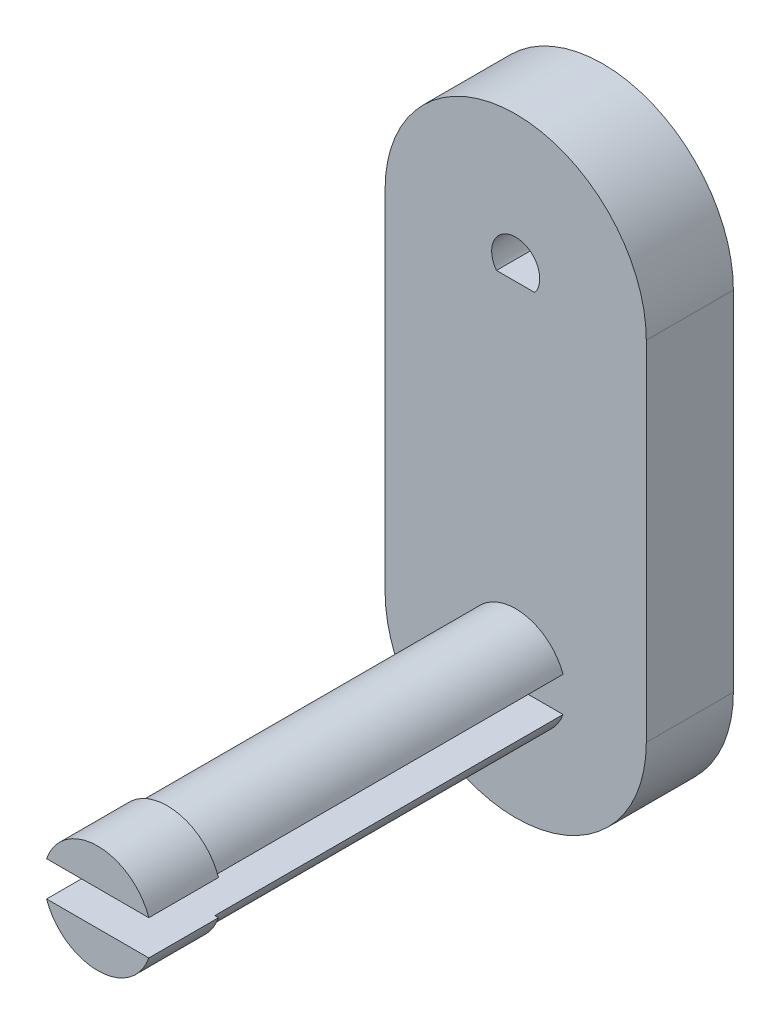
from build123d import *

# Parameters (mm, degrees)
BOSS_EXTRU_1_START      = 10
BOSS_EXTRU_1_DEPTH      = 5
ESQUISSE2_R             = 2.9
BOSS_EXTRU_2_DEPTH      = 20
ESQUISSE3_R             = 3.1
BOSS_EXTRU_3_DEPTH      = 4
ESQUISSE4_W             = 10
ESQUISSE4_H             = 2
ENL_V_MAT_EXTRU_1_DEPTH = 24
ENL_V_MAT_EXTRU_2_DEPTH = 24


with BuildPart() as part:
    # Esquisse1 → Boss.-Extru.1 (new body)
    with BuildSketch(Plane(origin=(0, 0, 0), x_dir=(-1, 0, 0), z_dir=(0, 0, -1)).offset(BOSS_EXTRU_1_START)):
        with BuildLine():
            Line((7.5, 0), (7.5, -20))
            ThreePointArc((7.5, -20), (0, -27.5), (-7.5, -20))
            Line((-7.5, -20), (-7.5, 0))
            ThreePointArc((-7.5, 0), (0, 7.5), (7.5, 0))
        make_face()
    extrude(amount=BOSS_EXTRU_1_DEPTH)

    # Esquisse2 → Boss.-Extru.2 (add)
    with BuildSketch(Plane.XY.offset(-10)):
        with Locations(Location((0, -20, 0), (0, 0, 180))):
            Circle(ESQUISSE2_R)
    extrude(amount=BOSS_EXTRU_2_DEPTH)

    # Esquisse3 → Boss.-Extru.3 (add)
    with BuildSketch(Plane.XY.offset(10)):
        with Locations((0, -20)):
            Circle(ESQUISSE3_R)
    extrude(amount=BOSS_EXTRU_3_DEPTH)

    # Esquisse4 → Enl_v. mat.-Extru.1 (cut)
    with BuildSketch(Plane.XY.offset(14)):
        with Locations((0, -20)):
            Rectangle(ESQUISSE4_W, ESQUISSE4_H)
    extrude(amount=-ENL_V_MAT_EXTRU_1_DEPTH, mode=Mode.SUBTRACT)

    # Esquisse5 → Enl_v. mat.-Extru.2 (cut)
    with BuildSketch(Plane.XY.offset(-10)):
        with BuildLine():
            Line((-1.102497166, -0.83), (1.102497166, -0.83))
            ThreePointArc((1.102497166, -0.83), (0, 1.38), (-1.102497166, -0.83))
        make_face()
    extrude(amount=-ENL_V_MAT_EXTRU_2_DEPTH, mode=Mode.SUBTRACT)


solid = part.part
